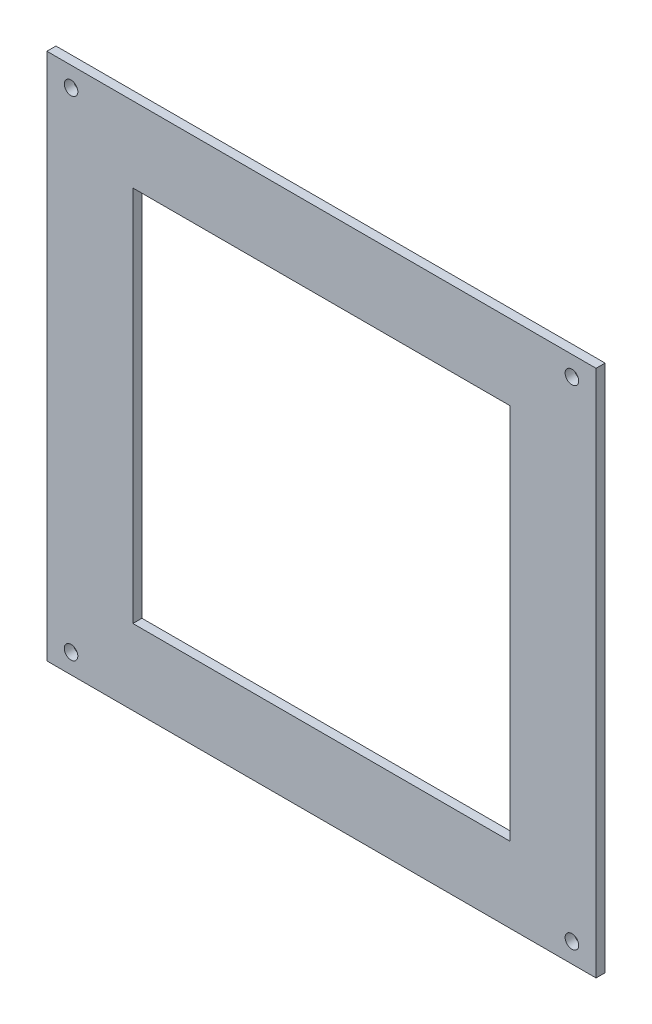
ISO-10303-21;
HEADER;
FILE_DESCRIPTION(('STEP AP214'),'2;1');
FILE_NAME('part.step','',(''),(''),'','','');
FILE_SCHEMA(('AUTOMOTIVE_DESIGN { 1 0 10303 214 1 1 1 1 }'));
ENDSEC;
DATA;
#1=APPLICATION_CONTEXT('core data for automotive mechanical design processes');
#2=APPLICATION_PROTOCOL_DEFINITION('international standard','automotive_design',2000,#1);
#3=PRODUCT_CONTEXT('',#1,'mechanical');
#4=PRODUCT('Part','Part','',(#3));
#5=PRODUCT_RELATED_PRODUCT_CATEGORY('part','',(#4));
#6=PRODUCT_DEFINITION_FORMATION('','',#4);
#7=PRODUCT_DEFINITION_CONTEXT('part definition',#1,'design');
#8=PRODUCT_DEFINITION('design','',#6,#7);
#9=PRODUCT_DEFINITION_SHAPE('','',#8);
#10=(LENGTH_UNIT() NAMED_UNIT(*) SI_UNIT(.MILLI.,.METRE.));
#11=(NAMED_UNIT(*) PLANE_ANGLE_UNIT() SI_UNIT($,.RADIAN.));
#12=(NAMED_UNIT(*) SI_UNIT($,.STERADIAN.) SOLID_ANGLE_UNIT());
#13=UNCERTAINTY_MEASURE_WITH_UNIT(LENGTH_MEASURE(1.E-05),#10,'distance_accuracy_value','');
#14=(GEOMETRIC_REPRESENTATION_CONTEXT(3) GLOBAL_UNCERTAINTY_ASSIGNED_CONTEXT((#13)) GLOBAL_UNIT_ASSIGNED_CONTEXT((#10,
#11,#12)) REPRESENTATION_CONTEXT('',''));
#15=CARTESIAN_POINT('',(0.,0.,0.));
#16=DIRECTION('',(0.,0.,1.));
#17=DIRECTION('',(1.,0.,0.));
#18=AXIS2_PLACEMENT_3D('',#15,#16,#17);
#19=CARTESIAN_POINT('',(0.,0.,6.));
#20=DIRECTION('',(0.,0.,1.));
#21=DIRECTION('',(1.,0.,0.));
#22=AXIS2_PLACEMENT_3D('',#19,#20,#21);
#23=PLANE('',#22);
#24=DIRECTION('',(0.,-1.,0.));
#25=VECTOR('',#24,1.);
#26=CARTESIAN_POINT('',(-125.,125.,6.));
#27=LINE('',#26,#25);
#28=CARTESIAN_POINT('',(-125.,125.,6.));
#29=VERTEX_POINT('',#28);
#30=CARTESIAN_POINT('',(-125.,-125.,6.));
#31=VERTEX_POINT('',#30);
#32=EDGE_CURVE('E24',#29,#31,#27,.T.);
#33=ORIENTED_EDGE('',*,*,#32,.F.);
#34=DIRECTION('',(-1.,0.,0.));
#35=VECTOR('',#34,1.);
#36=CARTESIAN_POINT('',(125.,125.,6.));
#37=LINE('',#36,#35);
#38=CARTESIAN_POINT('',(125.,125.,6.));
#39=VERTEX_POINT('',#38);
#40=EDGE_CURVE('E253',#39,#29,#37,.T.);
#41=ORIENTED_EDGE('',*,*,#40,.F.);
#42=DIRECTION('',(0.,1.,0.));
#43=VECTOR('',#42,1.);
#44=CARTESIAN_POINT('',(125.,-125.,6.));
#45=LINE('',#44,#43);
#46=CARTESIAN_POINT('',(125.,-125.,6.));
#47=VERTEX_POINT('',#46);
#48=EDGE_CURVE('E244',#47,#39,#45,.T.);
#49=ORIENTED_EDGE('',*,*,#48,.F.);
#50=DIRECTION('',(1.,0.,0.));
#51=VECTOR('',#50,1.);
#52=CARTESIAN_POINT('',(-125.,-125.,6.));
#53=LINE('',#52,#51);
#54=EDGE_CURVE('E232',#31,#47,#53,.T.);
#55=ORIENTED_EDGE('',*,*,#54,.F.);
#56=EDGE_LOOP('',(#33,#41,#49,#55));
#57=FACE_BOUND('',#56,.T.);
#58=CARTESIAN_POINT('',(166.,162.,6.));
#59=DIRECTION('',(0.,0.,1.));
#60=DIRECTION('',(1.,0.,0.));
#61=AXIS2_PLACEMENT_3D('',#58,#59,#60);
#62=CIRCLE('',#61,4.5);
#63=CARTESIAN_POINT('',(170.5,162.,6.));
#64=VERTEX_POINT('',#63);
#65=EDGE_CURVE('E222',#64,#64,#62,.T.);
#66=ORIENTED_EDGE('',*,*,#65,.F.);
#67=EDGE_LOOP('',(#66));
#68=FACE_BOUND('',#67,.T.);
#69=CARTESIAN_POINT('',(-166.,162.,6.));
#70=DIRECTION('',(0.,0.,1.));
#71=DIRECTION('',(1.,0.,0.));
#72=AXIS2_PLACEMENT_3D('',#69,#70,#71);
#73=CIRCLE('',#72,4.5);
#74=CARTESIAN_POINT('',(-161.5,162.,6.));
#75=VERTEX_POINT('',#74);
#76=EDGE_CURVE('E212',#75,#75,#73,.T.);
#77=ORIENTED_EDGE('',*,*,#76,.F.);
#78=EDGE_LOOP('',(#77));
#79=FACE_BOUND('',#78,.T.);
#80=CARTESIAN_POINT('',(166.,-162.,6.));
#81=DIRECTION('',(0.,0.,1.));
#82=DIRECTION('',(1.,0.,0.));
#83=AXIS2_PLACEMENT_3D('',#80,#81,#82);
#84=CIRCLE('',#83,4.5);
#85=CARTESIAN_POINT('',(170.5,-162.,6.));
#86=VERTEX_POINT('',#85);
#87=EDGE_CURVE('E202',#86,#86,#84,.T.);
#88=ORIENTED_EDGE('',*,*,#87,.F.);
#89=EDGE_LOOP('',(#88));
#90=FACE_BOUND('',#89,.T.);
#91=CARTESIAN_POINT('',(-166.,-162.,6.));
#92=DIRECTION('',(0.,0.,1.));
#93=DIRECTION('',(1.,0.,0.));
#94=AXIS2_PLACEMENT_3D('',#91,#92,#93);
#95=CIRCLE('',#94,4.5);
#96=CARTESIAN_POINT('',(-161.5,-162.,6.));
#97=VERTEX_POINT('',#96);
#98=EDGE_CURVE('E190',#97,#97,#95,.T.);
#99=ORIENTED_EDGE('',*,*,#98,.F.);
#100=EDGE_LOOP('',(#99));
#101=FACE_BOUND('',#100,.T.);
#102=DIRECTION('',(1.,0.,0.));
#103=VECTOR('',#102,1.);
#104=CARTESIAN_POINT('',(-182.,-175.,6.));
#105=LINE('',#104,#103);
#106=CARTESIAN_POINT('',(-182.,-175.,6.));
#107=VERTEX_POINT('',#106);
#108=CARTESIAN_POINT('',(182.,-175.,6.));
#109=VERTEX_POINT('',#108);
#110=EDGE_CURVE('E155',#107,#109,#105,.T.);
#111=ORIENTED_EDGE('',*,*,#110,.T.);
#112=DIRECTION('',(0.,1.,0.));
#113=VECTOR('',#112,1.);
#114=CARTESIAN_POINT('',(182.,-175.,6.));
#115=LINE('',#114,#113);
#116=CARTESIAN_POINT('',(182.,175.,6.));
#117=VERTEX_POINT('',#116);
#118=EDGE_CURVE('E150',#109,#117,#115,.T.);
#119=ORIENTED_EDGE('',*,*,#118,.T.);
#120=DIRECTION('',(-1.,0.,0.));
#121=VECTOR('',#120,1.);
#122=CARTESIAN_POINT('',(182.,175.,6.));
#123=LINE('',#122,#121);
#124=CARTESIAN_POINT('',(-182.,175.,6.));
#125=VERTEX_POINT('',#124);
#126=EDGE_CURVE('E178',#117,#125,#123,.T.);
#127=ORIENTED_EDGE('',*,*,#126,.T.);
#128=DIRECTION('',(0.,-1.,0.));
#129=VECTOR('',#128,1.);
#130=CARTESIAN_POINT('',(-182.,175.,6.));
#131=LINE('',#130,#129);
#132=EDGE_CURVE('E185',#125,#107,#131,.T.);
#133=ORIENTED_EDGE('',*,*,#132,.T.);
#134=EDGE_LOOP('',(#111,#119,#127,#133));
#135=FACE_BOUND('',#134,.T.);
#136=ADVANCED_FACE('F16',(#57,#68,#79,#90,#101,#135),#23,.T.);
#137=CARTESIAN_POINT('',(0.,0.,0.));
#138=DIRECTION('',(0.,0.,1.));
#139=DIRECTION('',(1.,0.,0.));
#140=AXIS2_PLACEMENT_3D('',#137,#138,#139);
#141=PLANE('',#140);
#142=DIRECTION('',(1.,0.,0.));
#143=VECTOR('',#142,1.);
#144=CARTESIAN_POINT('',(-125.,-125.,0.));
#145=LINE('',#144,#143);
#146=CARTESIAN_POINT('',(-125.,-125.,0.));
#147=VERTEX_POINT('',#146);
#148=CARTESIAN_POINT('',(125.,-125.,0.));
#149=VERTEX_POINT('',#148);
#150=EDGE_CURVE('E240',#147,#149,#145,.T.);
#151=ORIENTED_EDGE('',*,*,#150,.T.);
#152=DIRECTION('',(0.,1.,0.));
#153=VECTOR('',#152,1.);
#154=CARTESIAN_POINT('',(125.,-125.,0.));
#155=LINE('',#154,#153);
#156=CARTESIAN_POINT('',(125.,125.,0.));
#157=VERTEX_POINT('',#156);
#158=EDGE_CURVE('E252',#149,#157,#155,.T.);
#159=ORIENTED_EDGE('',*,*,#158,.T.);
#160=DIRECTION('',(-1.,0.,0.));
#161=VECTOR('',#160,1.);
#162=CARTESIAN_POINT('',(125.,125.,0.));
#163=LINE('',#162,#161);
#164=CARTESIAN_POINT('',(-125.,125.,0.));
#165=VERTEX_POINT('',#164);
#166=EDGE_CURVE('E263',#157,#165,#163,.T.);
#167=ORIENTED_EDGE('',*,*,#166,.T.);
#168=DIRECTION('',(0.,-1.,0.));
#169=VECTOR('',#168,1.);
#170=CARTESIAN_POINT('',(-125.,125.,0.));
#171=LINE('',#170,#169);
#172=EDGE_CURVE('E10',#165,#147,#171,.T.);
#173=ORIENTED_EDGE('',*,*,#172,.T.);
#174=EDGE_LOOP('',(#151,#159,#167,#173));
#175=FACE_BOUND('',#174,.T.);
#176=CARTESIAN_POINT('',(166.,162.,0.));
#177=DIRECTION('',(0.,0.,1.));
#178=DIRECTION('',(1.,0.,0.));
#179=AXIS2_PLACEMENT_3D('',#176,#177,#178);
#180=CIRCLE('',#179,4.5);
#181=CARTESIAN_POINT('',(170.5,162.,0.));
#182=VERTEX_POINT('',#181);
#183=EDGE_CURVE('E225',#182,#182,#180,.T.);
#184=ORIENTED_EDGE('',*,*,#183,.T.);
#185=EDGE_LOOP('',(#184));
#186=FACE_BOUND('',#185,.T.);
#187=CARTESIAN_POINT('',(-166.,162.,0.));
#188=DIRECTION('',(0.,0.,1.));
#189=DIRECTION('',(1.,0.,0.));
#190=AXIS2_PLACEMENT_3D('',#187,#188,#189);
#191=CIRCLE('',#190,4.5);
#192=CARTESIAN_POINT('',(-161.5,162.,0.));
#193=VERTEX_POINT('',#192);
#194=EDGE_CURVE('E215',#193,#193,#191,.T.);
#195=ORIENTED_EDGE('',*,*,#194,.T.);
#196=EDGE_LOOP('',(#195));
#197=FACE_BOUND('',#196,.T.);
#198=CARTESIAN_POINT('',(166.,-162.,0.));
#199=DIRECTION('',(0.,0.,1.));
#200=DIRECTION('',(1.,0.,0.));
#201=AXIS2_PLACEMENT_3D('',#198,#199,#200);
#202=CIRCLE('',#201,4.5);
#203=CARTESIAN_POINT('',(170.5,-162.,0.));
#204=VERTEX_POINT('',#203);
#205=EDGE_CURVE('E205',#204,#204,#202,.T.);
#206=ORIENTED_EDGE('',*,*,#205,.T.);
#207=EDGE_LOOP('',(#206));
#208=FACE_BOUND('',#207,.T.);
#209=CARTESIAN_POINT('',(-166.,-162.,0.));
#210=DIRECTION('',(0.,0.,1.));
#211=DIRECTION('',(1.,0.,0.));
#212=AXIS2_PLACEMENT_3D('',#209,#210,#211);
#213=CIRCLE('',#212,4.5);
#214=CARTESIAN_POINT('',(-161.5,-162.,0.));
#215=VERTEX_POINT('',#214);
#216=EDGE_CURVE('E186',#215,#215,#213,.T.);
#217=ORIENTED_EDGE('',*,*,#216,.T.);
#218=EDGE_LOOP('',(#217));
#219=FACE_BOUND('',#218,.T.);
#220=DIRECTION('',(0.,-1.,0.));
#221=VECTOR('',#220,1.);
#222=CARTESIAN_POINT('',(-182.,175.,0.));
#223=LINE('',#222,#221);
#224=CARTESIAN_POINT('',(-182.,175.,0.));
#225=VERTEX_POINT('',#224);
#226=CARTESIAN_POINT('',(-182.,-175.,0.));
#227=VERTEX_POINT('',#226);
#228=EDGE_CURVE('E182',#225,#227,#223,.T.);
#229=ORIENTED_EDGE('',*,*,#228,.F.);
#230=DIRECTION('',(-1.,0.,0.));
#231=VECTOR('',#230,1.);
#232=CARTESIAN_POINT('',(182.,175.,0.));
#233=LINE('',#232,#231);
#234=CARTESIAN_POINT('',(182.,175.,0.));
#235=VERTEX_POINT('',#234);
#236=EDGE_CURVE('E138',#235,#225,#233,.T.);
#237=ORIENTED_EDGE('',*,*,#236,.F.);
#238=DIRECTION('',(0.,1.,0.));
#239=VECTOR('',#238,1.);
#240=CARTESIAN_POINT('',(182.,-175.,0.));
#241=LINE('',#240,#239);
#242=CARTESIAN_POINT('',(182.,-175.,0.));
#243=VERTEX_POINT('',#242);
#244=EDGE_CURVE('E132',#243,#235,#241,.T.);
#245=ORIENTED_EDGE('',*,*,#244,.F.);
#246=DIRECTION('',(1.,0.,0.));
#247=VECTOR('',#246,1.);
#248=CARTESIAN_POINT('',(-182.,-175.,0.));
#249=LINE('',#248,#247);
#250=EDGE_CURVE('E136',#227,#243,#249,.T.);
#251=ORIENTED_EDGE('',*,*,#250,.F.);
#252=EDGE_LOOP('',(#229,#237,#245,#251));
#253=FACE_BOUND('',#252,.T.);
#254=ADVANCED_FACE('F134',(#175,#186,#197,#208,#219,#253),#141,.F.);
#255=CARTESIAN_POINT('',(-125.,125.,0.));
#256=DIRECTION('',(1.,0.,0.));
#257=DIRECTION('',(0.,1.,0.));
#258=AXIS2_PLACEMENT_3D('',#255,#256,#257);
#259=PLANE('',#258);
#260=DIRECTION('',(0.,0.,1.));
#261=VECTOR('',#260,1.);
#262=CARTESIAN_POINT('',(-125.,125.,0.));
#263=LINE('',#262,#261);
#264=EDGE_CURVE('E257',#165,#29,#263,.T.);
#265=ORIENTED_EDGE('',*,*,#264,.T.);
#266=ORIENTED_EDGE('',*,*,#32,.T.);
#267=DIRECTION('',(0.,0.,1.));
#268=VECTOR('',#267,1.);
#269=CARTESIAN_POINT('',(-125.,-125.,0.));
#270=LINE('',#269,#268);
#271=EDGE_CURVE('E228',#147,#31,#270,.T.);
#272=ORIENTED_EDGE('',*,*,#271,.F.);
#273=ORIENTED_EDGE('',*,*,#172,.F.);
#274=EDGE_LOOP('',(#265,#266,#272,#273));
#275=FACE_BOUND('',#274,.T.);
#276=ADVANCED_FACE('F267',(#275),#259,.T.);
#277=CARTESIAN_POINT('',(125.,125.,0.));
#278=DIRECTION('',(0.,-1.,0.));
#279=DIRECTION('',(0.,0.,-1.));
#280=AXIS2_PLACEMENT_3D('',#277,#278,#279);
#281=PLANE('',#280);
#282=DIRECTION('',(0.,0.,1.));
#283=VECTOR('',#282,1.);
#284=CARTESIAN_POINT('',(125.,125.,0.));
#285=LINE('',#284,#283);
#286=EDGE_CURVE('E248',#157,#39,#285,.T.);
#287=ORIENTED_EDGE('',*,*,#286,.T.);
#288=ORIENTED_EDGE('',*,*,#40,.T.);
#289=ORIENTED_EDGE('',*,*,#264,.F.);
#290=ORIENTED_EDGE('',*,*,#166,.F.);
#291=EDGE_LOOP('',(#287,#288,#289,#290));
#292=FACE_BOUND('',#291,.T.);
#293=ADVANCED_FACE('F278',(#292),#281,.T.);
#294=CARTESIAN_POINT('',(125.,-125.,0.));
#295=DIRECTION('',(-1.,0.,0.));
#296=DIRECTION('',(0.,0.,1.));
#297=AXIS2_PLACEMENT_3D('',#294,#295,#296);
#298=PLANE('',#297);
#299=DIRECTION('',(0.,0.,1.));
#300=VECTOR('',#299,1.);
#301=CARTESIAN_POINT('',(125.,-125.,0.));
#302=LINE('',#301,#300);
#303=EDGE_CURVE('E236',#149,#47,#302,.T.);
#304=ORIENTED_EDGE('',*,*,#303,.T.);
#305=ORIENTED_EDGE('',*,*,#48,.T.);
#306=ORIENTED_EDGE('',*,*,#286,.F.);
#307=ORIENTED_EDGE('',*,*,#158,.F.);
#308=EDGE_LOOP('',(#304,#305,#306,#307));
#309=FACE_BOUND('',#308,.T.);
#310=ADVANCED_FACE('F280',(#309),#298,.T.);
#311=CARTESIAN_POINT('',(-125.,-125.,0.));
#312=DIRECTION('',(0.,1.,0.));
#313=DIRECTION('',(1.,0.,0.));
#314=AXIS2_PLACEMENT_3D('',#311,#312,#313);
#315=PLANE('',#314);
#316=ORIENTED_EDGE('',*,*,#271,.T.);
#317=ORIENTED_EDGE('',*,*,#54,.T.);
#318=ORIENTED_EDGE('',*,*,#303,.F.);
#319=ORIENTED_EDGE('',*,*,#150,.F.);
#320=EDGE_LOOP('',(#316,#317,#318,#319));
#321=FACE_BOUND('',#320,.T.);
#322=ADVANCED_FACE('F273',(#321),#315,.T.);
#323=CARTESIAN_POINT('',(166.,162.,0.));
#324=DIRECTION('',(0.,0.,-1.));
#325=DIRECTION('',(1.,0.,0.));
#326=AXIS2_PLACEMENT_3D('',#323,#324,#325);
#327=CYLINDRICAL_SURFACE('',#326,4.5);
#328=DIRECTION('',(0.,0.,1.));
#329=VECTOR('',#328,1.);
#330=CARTESIAN_POINT('',(170.5,162.,0.));
#331=LINE('',#330,#329);
#332=EDGE_CURVE('E218',#182,#64,#331,.T.);
#333=ORIENTED_EDGE('',*,*,#332,.T.);
#334=ORIENTED_EDGE('',*,*,#65,.T.);
#335=ORIENTED_EDGE('',*,*,#332,.F.);
#336=ORIENTED_EDGE('',*,*,#183,.F.);
#337=EDGE_LOOP('',(#333,#334,#335,#336));
#338=FACE_BOUND('',#337,.T.);
#339=ADVANCED_FACE('F288',(#338),#327,.F.);
#340=CARTESIAN_POINT('',(-166.,162.,0.));
#341=DIRECTION('',(0.,0.,-1.));
#342=DIRECTION('',(1.,0.,0.));
#343=AXIS2_PLACEMENT_3D('',#340,#341,#342);
#344=CYLINDRICAL_SURFACE('',#343,4.5);
#345=DIRECTION('',(0.,0.,1.));
#346=VECTOR('',#345,1.);
#347=CARTESIAN_POINT('',(-161.5,162.,0.));
#348=LINE('',#347,#346);
#349=EDGE_CURVE('E208',#193,#75,#348,.T.);
#350=ORIENTED_EDGE('',*,*,#349,.T.);
#351=ORIENTED_EDGE('',*,*,#76,.T.);
#352=ORIENTED_EDGE('',*,*,#349,.F.);
#353=ORIENTED_EDGE('',*,*,#194,.F.);
#354=EDGE_LOOP('',(#350,#351,#352,#353));
#355=FACE_BOUND('',#354,.T.);
#356=ADVANCED_FACE('F300',(#355),#344,.F.);
#357=CARTESIAN_POINT('',(166.,-162.,0.));
#358=DIRECTION('',(0.,0.,-1.));
#359=DIRECTION('',(1.,0.,0.));
#360=AXIS2_PLACEMENT_3D('',#357,#358,#359);
#361=CYLINDRICAL_SURFACE('',#360,4.5);
#362=DIRECTION('',(0.,0.,1.));
#363=VECTOR('',#362,1.);
#364=CARTESIAN_POINT('',(170.5,-162.,0.));
#365=LINE('',#364,#363);
#366=EDGE_CURVE('E189',#204,#86,#365,.T.);
#367=ORIENTED_EDGE('',*,*,#366,.T.);
#368=ORIENTED_EDGE('',*,*,#87,.T.);
#369=ORIENTED_EDGE('',*,*,#366,.F.);
#370=ORIENTED_EDGE('',*,*,#205,.F.);
#371=EDGE_LOOP('',(#367,#368,#369,#370));
#372=FACE_BOUND('',#371,.T.);
#373=ADVANCED_FACE('F303',(#372),#361,.F.);
#374=CARTESIAN_POINT('',(-166.,-162.,0.));
#375=DIRECTION('',(0.,0.,-1.));
#376=DIRECTION('',(1.,0.,0.));
#377=AXIS2_PLACEMENT_3D('',#374,#375,#376);
#378=CYLINDRICAL_SURFACE('',#377,4.5);
#379=DIRECTION('',(0.,0.,1.));
#380=VECTOR('',#379,1.);
#381=CARTESIAN_POINT('',(-161.5,-162.,0.));
#382=LINE('',#381,#380);
#383=EDGE_CURVE('E193',#215,#97,#382,.T.);
#384=ORIENTED_EDGE('',*,*,#383,.T.);
#385=ORIENTED_EDGE('',*,*,#98,.T.);
#386=ORIENTED_EDGE('',*,*,#383,.F.);
#387=ORIENTED_EDGE('',*,*,#216,.F.);
#388=EDGE_LOOP('',(#384,#385,#386,#387));
#389=FACE_BOUND('',#388,.T.);
#390=ADVANCED_FACE('F305',(#389),#378,.F.);
#391=CARTESIAN_POINT('',(-182.,175.,0.));
#392=DIRECTION('',(1.,0.,0.));
#393=DIRECTION('',(0.,1.,0.));
#394=AXIS2_PLACEMENT_3D('',#391,#392,#393);
#395=PLANE('',#394);
#396=ORIENTED_EDGE('',*,*,#228,.T.);
#397=DIRECTION('',(0.,0.,1.));
#398=VECTOR('',#397,1.);
#399=CARTESIAN_POINT('',(-182.,-175.,0.));
#400=LINE('',#399,#398);
#401=EDGE_CURVE('E144',#227,#107,#400,.T.);
#402=ORIENTED_EDGE('',*,*,#401,.T.);
#403=ORIENTED_EDGE('',*,*,#132,.F.);
#404=DIRECTION('',(0.,0.,1.));
#405=VECTOR('',#404,1.);
#406=CARTESIAN_POINT('',(-182.,175.,0.));
#407=LINE('',#406,#405);
#408=EDGE_CURVE('E165',#225,#125,#407,.T.);
#409=ORIENTED_EDGE('',*,*,#408,.F.);
#410=EDGE_LOOP('',(#396,#402,#403,#409));
#411=FACE_BOUND('',#410,.T.);
#412=ADVANCED_FACE('F308',(#411),#395,.F.);
#413=CARTESIAN_POINT('',(182.,175.,0.));
#414=DIRECTION('',(0.,-1.,0.));
#415=DIRECTION('',(0.,0.,-1.));
#416=AXIS2_PLACEMENT_3D('',#413,#414,#415);
#417=PLANE('',#416);
#418=ORIENTED_EDGE('',*,*,#236,.T.);
#419=ORIENTED_EDGE('',*,*,#408,.T.);
#420=ORIENTED_EDGE('',*,*,#126,.F.);
#421=DIRECTION('',(0.,0.,1.));
#422=VECTOR('',#421,1.);
#423=CARTESIAN_POINT('',(182.,175.,0.));
#424=LINE('',#423,#422);
#425=EDGE_CURVE('E143',#235,#117,#424,.T.);
#426=ORIENTED_EDGE('',*,*,#425,.F.);
#427=EDGE_LOOP('',(#418,#419,#420,#426));
#428=FACE_BOUND('',#427,.T.);
#429=ADVANCED_FACE('F312',(#428),#417,.F.);
#430=CARTESIAN_POINT('',(182.,-175.,0.));
#431=DIRECTION('',(-1.,0.,0.));
#432=DIRECTION('',(0.,0.,1.));
#433=AXIS2_PLACEMENT_3D('',#430,#431,#432);
#434=PLANE('',#433);
#435=ORIENTED_EDGE('',*,*,#244,.T.);
#436=ORIENTED_EDGE('',*,*,#425,.T.);
#437=ORIENTED_EDGE('',*,*,#118,.F.);
#438=DIRECTION('',(0.,0.,1.));
#439=VECTOR('',#438,1.);
#440=CARTESIAN_POINT('',(182.,-175.,0.));
#441=LINE('',#440,#439);
#442=EDGE_CURVE('E147',#243,#109,#441,.T.);
#443=ORIENTED_EDGE('',*,*,#442,.F.);
#444=EDGE_LOOP('',(#435,#436,#437,#443));
#445=FACE_BOUND('',#444,.T.);
#446=ADVANCED_FACE('F148',(#445),#434,.F.);
#447=CARTESIAN_POINT('',(-182.,-175.,0.));
#448=DIRECTION('',(0.,1.,0.));
#449=DIRECTION('',(1.,0.,0.));
#450=AXIS2_PLACEMENT_3D('',#447,#448,#449);
#451=PLANE('',#450);
#452=ORIENTED_EDGE('',*,*,#250,.T.);
#453=ORIENTED_EDGE('',*,*,#442,.T.);
#454=ORIENTED_EDGE('',*,*,#110,.F.);
#455=ORIENTED_EDGE('',*,*,#401,.F.);
#456=EDGE_LOOP('',(#452,#453,#454,#455));
#457=FACE_BOUND('',#456,.T.);
#458=ADVANCED_FACE('F158',(#457),#451,.F.);
#459=CLOSED_SHELL('',(#136,#254,#276,#293,#310,#322,#339,#356,#373,#390,#412,#429,#446,#458));
#460=MANIFOLD_SOLID_BREP('B1',#459);
#461=ADVANCED_BREP_SHAPE_REPRESENTATION('',(#18,#460),#14);
#462=SHAPE_DEFINITION_REPRESENTATION(#9,#461);
ENDSEC;
END-ISO-10303-21;
